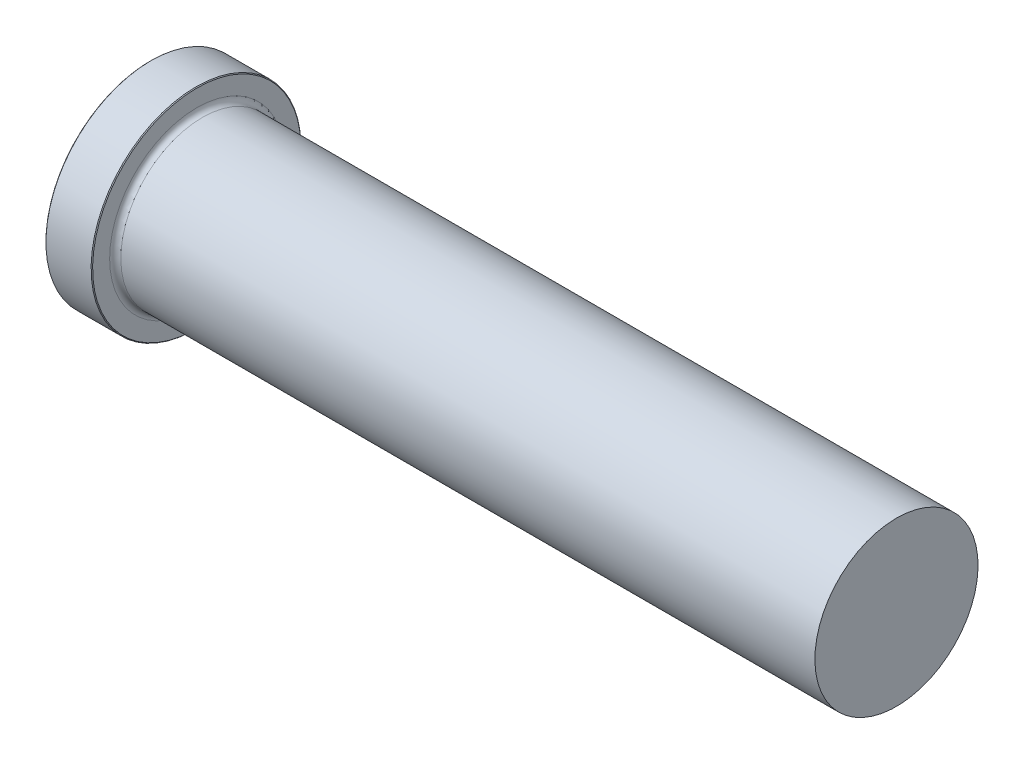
ISO-10303-21;
HEADER;
FILE_DESCRIPTION(('STEP AP214'),'2;1');
FILE_NAME('part.step','',(''),(''),'','','');
FILE_SCHEMA(('AUTOMOTIVE_DESIGN { 1 0 10303 214 1 1 1 1 }'));
ENDSEC;
DATA;
#1=APPLICATION_CONTEXT('core data for automotive mechanical design processes');
#2=APPLICATION_PROTOCOL_DEFINITION('international standard','automotive_design',2000,#1);
#3=PRODUCT_CONTEXT('',#1,'mechanical');
#4=PRODUCT('Part','Part','',(#3));
#5=PRODUCT_RELATED_PRODUCT_CATEGORY('part','',(#4));
#6=PRODUCT_DEFINITION_FORMATION('','',#4);
#7=PRODUCT_DEFINITION_CONTEXT('part definition',#1,'design');
#8=PRODUCT_DEFINITION('design','',#6,#7);
#9=PRODUCT_DEFINITION_SHAPE('','',#8);
#10=(LENGTH_UNIT() NAMED_UNIT(*) SI_UNIT(.MILLI.,.METRE.));
#11=(NAMED_UNIT(*) PLANE_ANGLE_UNIT() SI_UNIT($,.RADIAN.));
#12=(NAMED_UNIT(*) SI_UNIT($,.STERADIAN.) SOLID_ANGLE_UNIT());
#13=UNCERTAINTY_MEASURE_WITH_UNIT(LENGTH_MEASURE(1.E-05),#10,'distance_accuracy_value','');
#14=(GEOMETRIC_REPRESENTATION_CONTEXT(3) GLOBAL_UNCERTAINTY_ASSIGNED_CONTEXT((#13)) GLOBAL_UNIT_ASSIGNED_CONTEXT((#10,
#11,#12)) REPRESENTATION_CONTEXT('',''));
#15=CARTESIAN_POINT('',(0.,0.,0.));
#16=DIRECTION('',(0.,0.,1.));
#17=DIRECTION('',(1.,0.,0.));
#18=AXIS2_PLACEMENT_3D('',#15,#16,#17);
#19=CARTESIAN_POINT('',(101.6,11.10615,0.));
#20=DIRECTION('',(1.,0.,0.));
#21=DIRECTION('',(0.,1.,0.));
#22=AXIS2_PLACEMENT_3D('',#19,#20,#21);
#23=PLANE('',#22);
#24=CARTESIAN_POINT('',(101.6,0.,0.));
#25=DIRECTION('',(1.,0.,0.));
#26=DIRECTION('',(0.,1.,0.));
#27=AXIS2_PLACEMENT_3D('',#24,#25,#26);
#28=CIRCLE('',#27,11.10615);
#29=CARTESIAN_POINT('',(101.6,11.10615,0.));
#30=VERTEX_POINT('',#29);
#31=EDGE_CURVE('E50',#30,#30,#28,.T.);
#32=ORIENTED_EDGE('',*,*,#31,.T.);
#33=EDGE_LOOP('',(#32));
#34=FACE_BOUND('',#33,.T.);
#35=ADVANCED_FACE('F30',(#34),#23,.T.);
#36=CARTESIAN_POINT('',(101.6,0.,0.));
#37=DIRECTION('',(1.,0.,0.));
#38=DIRECTION('',(0.,1.,0.));
#39=AXIS2_PLACEMENT_3D('',#36,#37,#38);
#40=CYLINDRICAL_SURFACE('',#39,11.10615);
#41=CARTESIAN_POINT('',(7.11199999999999,0.,0.));
#42=DIRECTION('',(1.,0.,0.));
#43=DIRECTION('',(0.,1.,0.));
#44=AXIS2_PLACEMENT_3D('',#41,#42,#43);
#45=CIRCLE('',#44,11.10615);
#46=CARTESIAN_POINT('',(7.11199999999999,11.10615,0.));
#47=VERTEX_POINT('',#46);
#48=EDGE_CURVE('E53',#47,#47,#45,.T.);
#49=ORIENTED_EDGE('',*,*,#48,.T.);
#50=EDGE_LOOP('',(#49));
#51=FACE_BOUND('',#50,.T.);
#52=ORIENTED_EDGE('',*,*,#31,.F.);
#53=EDGE_LOOP('',(#52));
#54=FACE_BOUND('',#53,.T.);
#55=ADVANCED_FACE('F74',(#51,#54),#40,.T.);
#56=CARTESIAN_POINT('',(7.112,0.,0.));
#57=DIRECTION('',(1.,0.,0.));
#58=DIRECTION('',(0.,1.,0.));
#59=AXIS2_PLACEMENT_3D('',#56,#57,#58);
#60=TOROIDAL_SURFACE('',#59,11.86815,0.762);
#61=CARTESIAN_POINT('',(6.34999999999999,0.,0.));
#62=DIRECTION('',(1.,0.,0.));
#63=DIRECTION('',(0.,1.,0.));
#64=AXIS2_PLACEMENT_3D('',#61,#62,#63);
#65=CIRCLE('',#64,11.86815);
#66=CARTESIAN_POINT('',(6.35,11.86815,0.));
#67=VERTEX_POINT('',#66);
#68=EDGE_CURVE('E56',#67,#67,#65,.T.);
#69=ORIENTED_EDGE('',*,*,#68,.T.);
#70=EDGE_LOOP('',(#69));
#71=FACE_BOUND('',#70,.T.);
#72=ORIENTED_EDGE('',*,*,#48,.F.);
#73=EDGE_LOOP('',(#72));
#74=FACE_BOUND('',#73,.T.);
#75=ADVANCED_FACE('F60',(#71,#74),#60,.F.);
#76=CARTESIAN_POINT('',(6.35,14.2875,0.));
#77=DIRECTION('',(1.,0.,0.));
#78=DIRECTION('',(0.,1.,0.));
#79=AXIS2_PLACEMENT_3D('',#76,#77,#78);
#80=PLANE('',#79);
#81=CARTESIAN_POINT('',(6.35,0.,0.));
#82=DIRECTION('',(1.,0.,0.));
#83=DIRECTION('',(0.,1.,0.));
#84=AXIS2_PLACEMENT_3D('',#81,#82,#83);
#85=CIRCLE('',#84,14.1859);
#86=CARTESIAN_POINT('',(6.35,14.1859,0.));
#87=VERTEX_POINT('',#86);
#88=EDGE_CURVE('E10',#87,#87,#85,.T.);
#89=ORIENTED_EDGE('',*,*,#88,.T.);
#90=EDGE_LOOP('',(#89));
#91=FACE_BOUND('',#90,.T.);
#92=ORIENTED_EDGE('',*,*,#68,.F.);
#93=EDGE_LOOP('',(#92));
#94=FACE_BOUND('',#93,.T.);
#95=ADVANCED_FACE('F63',(#91,#94),#80,.T.);
#96=CARTESIAN_POINT('',(101.6,0.,0.));
#97=DIRECTION('',(1.,0.,0.));
#98=DIRECTION('',(0.,1.,0.));
#99=AXIS2_PLACEMENT_3D('',#96,#97,#98);
#100=CYLINDRICAL_SURFACE('',#99,14.2875);
#101=CARTESIAN_POINT('',(0.101600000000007,0.,0.));
#102=DIRECTION('',(-1.,0.,0.));
#103=DIRECTION('',(0.,-1.,0.));
#104=AXIS2_PLACEMENT_3D('',#101,#102,#103);
#105=CIRCLE('',#104,14.2875);
#106=CARTESIAN_POINT('',(0.101600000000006,-14.2875,0.));
#107=VERTEX_POINT('',#106);
#108=EDGE_CURVE('E41',#107,#107,#105,.F.);
#109=ORIENTED_EDGE('',*,*,#108,.T.);
#110=EDGE_LOOP('',(#109));
#111=FACE_BOUND('',#110,.T.);
#112=CARTESIAN_POINT('',(6.24839999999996,0.,0.));
#113=DIRECTION('',(1.,0.,0.));
#114=DIRECTION('',(0.,1.,0.));
#115=AXIS2_PLACEMENT_3D('',#112,#113,#114);
#116=CIRCLE('',#115,14.2875);
#117=CARTESIAN_POINT('',(6.24839999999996,14.2875,0.));
#118=VERTEX_POINT('',#117);
#119=EDGE_CURVE('E45',#118,#118,#116,.F.);
#120=ORIENTED_EDGE('',*,*,#119,.T.);
#121=EDGE_LOOP('',(#120));
#122=FACE_BOUND('',#121,.T.);
#123=ADVANCED_FACE('F65',(#111,#122),#100,.T.);
#124=CARTESIAN_POINT('',(0.,0.,0.));
#125=DIRECTION('',(-1.,0.,0.));
#126=DIRECTION('',(0.,-1.,0.));
#127=AXIS2_PLACEMENT_3D('',#124,#125,#126);
#128=PLANE('',#127);
#129=CARTESIAN_POINT('',(0.,0.,0.));
#130=DIRECTION('',(-1.,0.,0.));
#131=DIRECTION('',(0.,-1.,0.));
#132=AXIS2_PLACEMENT_3D('',#129,#130,#131);
#133=CIRCLE('',#132,14.1859);
#134=CARTESIAN_POINT('',(0.,-14.1859,0.));
#135=VERTEX_POINT('',#134);
#136=EDGE_CURVE('E37',#135,#135,#133,.T.);
#137=ORIENTED_EDGE('',*,*,#136,.T.);
#138=EDGE_LOOP('',(#137));
#139=FACE_BOUND('',#138,.T.);
#140=ADVANCED_FACE('F71',(#139),#128,.T.);
#141=CARTESIAN_POINT('',(0.101600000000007,0.,0.));
#142=DIRECTION('',(1.,0.,0.));
#143=DIRECTION('',(0.,1.,0.));
#144=AXIS2_PLACEMENT_3D('',#141,#142,#143);
#145=CONICAL_SURFACE('',#144,14.2875,0.785398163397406);
#146=ORIENTED_EDGE('',*,*,#136,.F.);
#147=EDGE_LOOP('',(#146));
#148=FACE_BOUND('',#147,.T.);
#149=ORIENTED_EDGE('',*,*,#108,.F.);
#150=EDGE_LOOP('',(#149));
#151=FACE_BOUND('',#150,.T.);
#152=ADVANCED_FACE('F84',(#148,#151),#145,.T.);
#153=CARTESIAN_POINT('',(6.34999999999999,0.,0.));
#154=DIRECTION('',(-1.,0.,0.));
#155=DIRECTION('',(0.,-1.,0.));
#156=AXIS2_PLACEMENT_3D('',#153,#154,#155);
#157=CONICAL_SURFACE('',#156,14.1859,0.785398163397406);
#158=ORIENTED_EDGE('',*,*,#119,.F.);
#159=EDGE_LOOP('',(#158));
#160=FACE_BOUND('',#159,.T.);
#161=ORIENTED_EDGE('',*,*,#88,.F.);
#162=EDGE_LOOP('',(#161));
#163=FACE_BOUND('',#162,.T.);
#164=ADVANCED_FACE('F32',(#160,#163),#157,.T.);
#165=CLOSED_SHELL('',(#35,#55,#75,#95,#123,#140,#152,#164));
#166=MANIFOLD_SOLID_BREP('B2',#165);
#167=ADVANCED_BREP_SHAPE_REPRESENTATION('',(#18,#166),#14);
#168=SHAPE_DEFINITION_REPRESENTATION(#9,#167);
ENDSEC;
END-ISO-10303-21;
